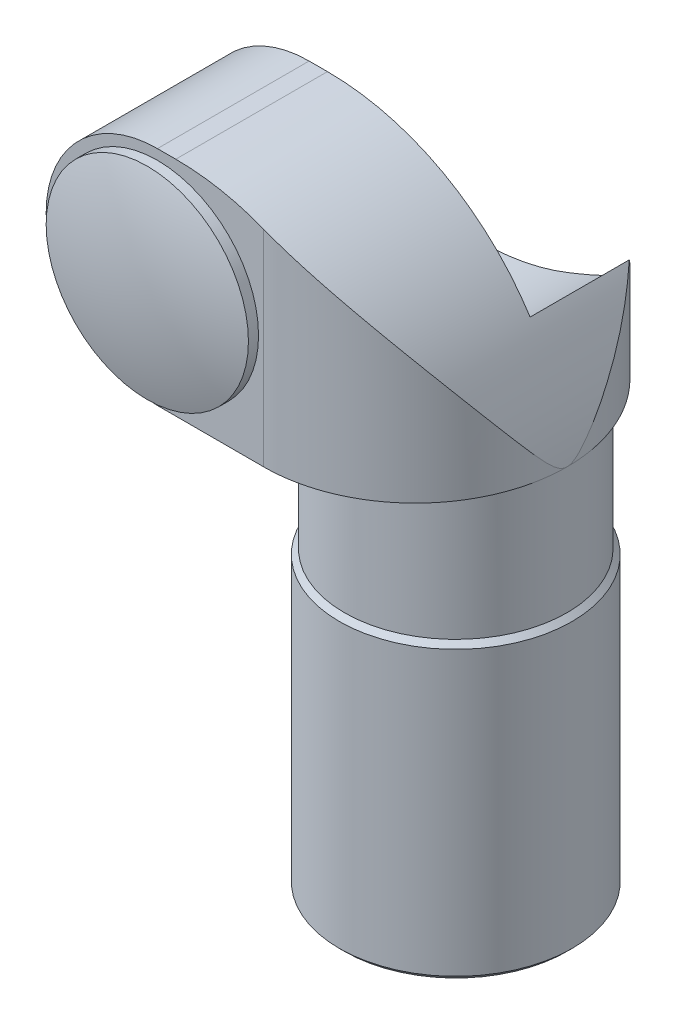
ISO-10303-21;
HEADER;
FILE_DESCRIPTION(('STEP AP214'),'2;1');
FILE_NAME('part.step','',(''),(''),'','','');
FILE_SCHEMA(('AUTOMOTIVE_DESIGN { 1 0 10303 214 1 1 1 1 }'));
ENDSEC;
DATA;
#1=APPLICATION_CONTEXT('core data for automotive mechanical design processes');
#2=APPLICATION_PROTOCOL_DEFINITION('international standard','automotive_design',2000,#1);
#3=PRODUCT_CONTEXT('',#1,'mechanical');
#4=PRODUCT('Part','Part','',(#3));
#5=PRODUCT_RELATED_PRODUCT_CATEGORY('part','',(#4));
#6=PRODUCT_DEFINITION_FORMATION('','',#4);
#7=PRODUCT_DEFINITION_CONTEXT('part definition',#1,'design');
#8=PRODUCT_DEFINITION('design','',#6,#7);
#9=PRODUCT_DEFINITION_SHAPE('','',#8);
#10=(LENGTH_UNIT() NAMED_UNIT(*) SI_UNIT(.MILLI.,.METRE.));
#11=(NAMED_UNIT(*) PLANE_ANGLE_UNIT() SI_UNIT($,.RADIAN.));
#12=(NAMED_UNIT(*) SI_UNIT($,.STERADIAN.) SOLID_ANGLE_UNIT());
#13=UNCERTAINTY_MEASURE_WITH_UNIT(LENGTH_MEASURE(1.E-05),#10,'distance_accuracy_value','');
#14=(GEOMETRIC_REPRESENTATION_CONTEXT(3) GLOBAL_UNCERTAINTY_ASSIGNED_CONTEXT((#13)) GLOBAL_UNIT_ASSIGNED_CONTEXT((#10,
#11,#12)) REPRESENTATION_CONTEXT('',''));
#15=CARTESIAN_POINT('',(0.,0.,0.));
#16=DIRECTION('',(0.,0.,1.));
#17=DIRECTION('',(1.,0.,0.));
#18=AXIS2_PLACEMENT_3D('',#15,#16,#17);
#19=CARTESIAN_POINT('',(-29.,0.,30.));
#20=DIRECTION('',(0.,0.,1.));
#21=DIRECTION('',(1.,0.,0.));
#22=AXIS2_PLACEMENT_3D('',#19,#20,#21);
#23=PLANE('',#22);
#24=DIRECTION('',(0.,1.,0.));
#25=VECTOR('',#24,1.);
#26=CARTESIAN_POINT('',(-8.,-22.,30.));
#27=LINE('',#26,#25);
#28=CARTESIAN_POINT('',(-8.,-22.,30.));
#29=VERTEX_POINT('',#28);
#30=CARTESIAN_POINT('',(-7.99999999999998,18.7097571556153,30.));
#31=VERTEX_POINT('',#30);
#32=EDGE_CURVE('E175',#29,#31,#27,.T.);
#33=ORIENTED_EDGE('',*,*,#32,.T.);
#34=CARTESIAN_POINT('',(-25.370877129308,-25.5,30.));
#35=DIRECTION('',(0.,0.,1.));
#36=DIRECTION('',(-1.,0.,0.));
#37=AXIS2_PLACEMENT_3D('',#34,#35,#36);
#38=CIRCLE('',#37,47.5);
#39=CARTESIAN_POINT('',(-25.370877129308,22.,30.));
#40=VERTEX_POINT('',#39);
#41=EDGE_CURVE('E200',#31,#40,#38,.T.);
#42=ORIENTED_EDGE('',*,*,#41,.T.);
#43=DIRECTION('',(-1.,0.,0.));
#44=VECTOR('',#43,1.);
#45=CARTESIAN_POINT('',(-29.,22.,30.));
#46=LINE('',#45,#44);
#47=CARTESIAN_POINT('',(-29.,22.,30.));
#48=VERTEX_POINT('',#47);
#49=EDGE_CURVE('E118',#40,#48,#46,.T.);
#50=ORIENTED_EDGE('',*,*,#49,.T.);
#51=CARTESIAN_POINT('',(-29.,0.,30.));
#52=DIRECTION('',(0.,0.,1.));
#53=DIRECTION('',(1.,0.,0.));
#54=AXIS2_PLACEMENT_3D('',#51,#52,#53);
#55=CIRCLE('',#54,22.);
#56=CARTESIAN_POINT('',(-29.,-22.,30.));
#57=VERTEX_POINT('',#56);
#58=EDGE_CURVE('E194',#48,#57,#55,.T.);
#59=ORIENTED_EDGE('',*,*,#58,.T.);
#60=DIRECTION('',(1.,0.,0.));
#61=VECTOR('',#60,1.);
#62=CARTESIAN_POINT('',(-29.,-22.,30.));
#63=LINE('',#62,#61);
#64=EDGE_CURVE('E197',#57,#29,#63,.T.);
#65=ORIENTED_EDGE('',*,*,#64,.T.);
#66=EDGE_LOOP('',(#33,#42,#50,#59,#65));
#67=FACE_BOUND('',#66,.T.);
#68=CARTESIAN_POINT('',(-29.,0.,30.));
#69=DIRECTION('',(0.,0.,1.));
#70=DIRECTION('',(1.,0.,0.));
#71=AXIS2_PLACEMENT_3D('',#68,#69,#70);
#72=CIRCLE('',#71,20.);
#73=CARTESIAN_POINT('',(-8.99999999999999,0.,30.));
#74=VERTEX_POINT('',#73);
#75=EDGE_CURVE('E227',#74,#74,#72,.T.);
#76=ORIENTED_EDGE('',*,*,#75,.F.);
#77=EDGE_LOOP('',(#76));
#78=FACE_BOUND('',#77,.T.);
#79=ADVANCED_FACE('F32',(#67,#78),#23,.T.);
#80=CARTESIAN_POINT('',(-29.,-22.,30.));
#81=DIRECTION('',(0.,1.,0.));
#82=DIRECTION('',(-1.,0.,0.));
#83=AXIS2_PLACEMENT_3D('',#80,#81,#82);
#84=PLANE('',#83);
#85=DIRECTION('',(0.,0.,1.));
#86=VECTOR('',#85,1.);
#87=CARTESIAN_POINT('',(-25.370877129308,-22.,-30.));
#88=LINE('',#87,#86);
#89=CARTESIAN_POINT('',(-25.370877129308,-22.,-30.));
#90=VERTEX_POINT('',#89);
#91=CARTESIAN_POINT('',(-25.370877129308,-22.,0.));
#92=VERTEX_POINT('',#91);
#93=EDGE_CURVE('E218',#90,#92,#88,.T.);
#94=ORIENTED_EDGE('',*,*,#93,.F.);
#95=DIRECTION('',(1.,0.,0.));
#96=VECTOR('',#95,1.);
#97=CARTESIAN_POINT('',(-29.,-22.,-30.));
#98=LINE('',#97,#96);
#99=CARTESIAN_POINT('',(-7.99999999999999,-22.,-30.));
#100=VERTEX_POINT('',#99);
#101=EDGE_CURVE('E55',#90,#100,#98,.T.);
#102=ORIENTED_EDGE('',*,*,#101,.T.);
#103=CARTESIAN_POINT('',(-8.,-22.,0.));
#104=DIRECTION('',(0.,-1.,0.));
#105=DIRECTION('',(1.,0.,0.));
#106=AXIS2_PLACEMENT_3D('',#103,#104,#105);
#107=CIRCLE('',#106,30.);
#108=CARTESIAN_POINT('',(22.,-22.,0.));
#109=VERTEX_POINT('',#108);
#110=EDGE_CURVE('E209',#100,#109,#107,.T.);
#111=ORIENTED_EDGE('',*,*,#110,.T.);
#112=CARTESIAN_POINT('',(0.,-22.,0.));
#113=DIRECTION('',(0.,1.,0.));
#114=DIRECTION('',(0.,0.,1.));
#115=AXIS2_PLACEMENT_3D('',#112,#113,#114);
#116=CIRCLE('',#115,22.);
#117=EDGE_CURVE('E178',#109,#109,#116,.T.);
#118=ORIENTED_EDGE('',*,*,#117,.T.);
#119=EDGE_CURVE('E207',#109,#29,#107,.T.);
#120=ORIENTED_EDGE('',*,*,#119,.T.);
#121=ORIENTED_EDGE('',*,*,#64,.F.);
#122=DIRECTION('',(0.,0.,-1.));
#123=VECTOR('',#122,1.);
#124=CARTESIAN_POINT('',(-29.,-22.,30.));
#125=LINE('',#124,#123);
#126=CARTESIAN_POINT('',(-29.,-22.,0.));
#127=VERTEX_POINT('',#126);
#128=EDGE_CURVE('E41',#57,#127,#125,.T.);
#129=ORIENTED_EDGE('',*,*,#128,.T.);
#130=DIRECTION('',(1.,0.,0.));
#131=VECTOR('',#130,1.);
#132=CARTESIAN_POINT('',(-29.,-22.,0.));
#133=LINE('',#132,#131);
#134=EDGE_CURVE('E205',#127,#92,#133,.T.);
#135=ORIENTED_EDGE('',*,*,#134,.T.);
#136=EDGE_LOOP('',(#94,#102,#111,#118,#120,#121,#129,#135));
#137=FACE_BOUND('',#136,.T.);
#138=ADVANCED_FACE('F149',(#137),#84,.F.);
#139=CARTESIAN_POINT('',(-29.,0.,30.));
#140=DIRECTION('',(0.,0.,-1.));
#141=DIRECTION('',(-1.,0.,0.));
#142=AXIS2_PLACEMENT_3D('',#139,#140,#141);
#143=CYLINDRICAL_SURFACE('',#142,22.);
#144=DIRECTION('',(0.,0.,-1.));
#145=VECTOR('',#144,1.);
#146=CARTESIAN_POINT('',(-29.,22.,30.));
#147=LINE('',#146,#145);
#148=CARTESIAN_POINT('',(-29.,22.,0.));
#149=VERTEX_POINT('',#148);
#150=EDGE_CURVE('E119',#48,#149,#147,.T.);
#151=ORIENTED_EDGE('',*,*,#150,.T.);
#152=CARTESIAN_POINT('',(-29.,0.,0.));
#153=DIRECTION('',(0.,0.,1.));
#154=DIRECTION('',(1.,0.,0.));
#155=AXIS2_PLACEMENT_3D('',#152,#153,#154);
#156=CIRCLE('',#155,22.);
#157=EDGE_CURVE('E101',#149,#127,#156,.T.);
#158=ORIENTED_EDGE('',*,*,#157,.T.);
#159=ORIENTED_EDGE('',*,*,#128,.F.);
#160=ORIENTED_EDGE('',*,*,#58,.F.);
#161=EDGE_LOOP('',(#151,#158,#159,#160));
#162=FACE_BOUND('',#161,.T.);
#163=ADVANCED_FACE('F155',(#162),#143,.T.);
#164=CARTESIAN_POINT('',(-25.370877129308,-25.5,30.));
#165=DIRECTION('',(0.,0.,-1.));
#166=DIRECTION('',(-1.,0.,0.));
#167=AXIS2_PLACEMENT_3D('',#164,#165,#166);
#168=CYLINDRICAL_SURFACE('',#167,47.5);
#169=CARTESIAN_POINT('',(-7.99999999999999,18.7097571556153,30.));
#170=CARTESIAN_POINT('',(-7.56651433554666,18.5394487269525,30.0000097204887));
#171=CARTESIAN_POINT('',(-7.1355781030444,18.362749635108,29.990605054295));
#172=CARTESIAN_POINT('',(-6.27980889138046,17.9970941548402,29.9537005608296));
#173=CARTESIAN_POINT('',(-5.85497483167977,17.8081399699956,29.9262039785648));
#174=CARTESIAN_POINT('',(-5.01290872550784,17.4187377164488,29.8539045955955));
#175=CARTESIAN_POINT('',(-4.59566595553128,17.2183078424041,29.8091285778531));
#176=CARTESIAN_POINT('',(-3.76890543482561,16.8062437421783,29.7030569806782));
#177=CARTESIAN_POINT('',(-3.35938802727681,16.5946090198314,29.6417606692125));
#178=CARTESIAN_POINT('',(-2.15202468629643,15.9483015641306,29.4357404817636));
#179=CARTESIAN_POINT('',(-1.36627834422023,15.4980098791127,29.268070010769));
#180=CARTESIAN_POINT('',(0.168412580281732,14.5600132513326,28.8774098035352));
#181=CARTESIAN_POINT('',(0.917338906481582,14.0722900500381,28.6543929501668));
#182=CARTESIAN_POINT('',(2.5531621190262,12.9410274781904,28.0988857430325));
#183=CARTESIAN_POINT('',(3.42927347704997,12.2884563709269,27.7529618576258));
#184=CARTESIAN_POINT('',(5.11749358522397,10.9400505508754,26.9960676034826));
#185=CARTESIAN_POINT('',(5.92959315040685,10.2442096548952,26.5850879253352));
#186=CARTESIAN_POINT('',(7.49285473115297,8.81259008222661,25.705633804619));
#187=CARTESIAN_POINT('',(8.24369978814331,8.07663296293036,25.2368883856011));
#188=CARTESIAN_POINT('',(9.68040760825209,6.57395304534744,24.2520491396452));
#189=CARTESIAN_POINT('',(10.3662666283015,5.80722847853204,23.7359525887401));
#190=CARTESIAN_POINT('',(11.9300216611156,3.94309939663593,22.453913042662));
#191=CARTESIAN_POINT('',(12.7782202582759,2.83356125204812,21.6691497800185));
#192=CARTESIAN_POINT('',(13.9610019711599,1.14071491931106,20.4459341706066));
#193=CARTESIAN_POINT('',(14.3404573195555,0.57147725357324,20.0303675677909));
#194=CARTESIAN_POINT('',(15.0701504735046,-0.575410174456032,19.1854034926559));
#195=CARTESIAN_POINT('',(15.420388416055,-1.15305989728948,18.7560060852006));
#196=CARTESIAN_POINT('',(16.4271284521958,-2.89526047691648,17.4505721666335));
#197=CARTESIAN_POINT('',(17.0409444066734,-4.07091858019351,16.5559483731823));
#198=CARTESIAN_POINT('',(17.8788126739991,-5.84946117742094,15.1846539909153));
#199=CARTESIAN_POINT('',(18.1442648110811,-6.44474259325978,14.722722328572));
#200=CARTESIAN_POINT('',(18.6481619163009,-7.63958107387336,13.7897254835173));
#201=CARTESIAN_POINT('',(18.8866076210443,-8.23913802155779,13.3186605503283));
#202=CARTESIAN_POINT('',(19.4348396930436,-9.70297471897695,12.1613875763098));
#203=CARTESIAN_POINT('',(19.7305689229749,-10.5690135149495,11.4706872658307));
#204=CARTESIAN_POINT('',(20.1339114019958,-11.8702367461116,10.4222411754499));
#205=CARTESIAN_POINT('',(20.2616448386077,-12.304316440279,10.0707114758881));
#206=CARTESIAN_POINT('',(20.5038360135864,-13.1726366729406,9.36328408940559));
#207=CARTESIAN_POINT('',(20.6182936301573,-13.6068772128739,9.00738636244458));
#208=CARTESIAN_POINT('',(20.8756491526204,-14.6421721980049,8.15267084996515));
#209=CARTESIAN_POINT('',(21.0124862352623,-15.2429587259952,7.65168036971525));
#210=CARTESIAN_POINT('',(21.1987780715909,-16.1399604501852,6.89195452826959));
#211=CARTESIAN_POINT('',(21.2576644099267,-16.4379635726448,6.63760221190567));
#212=CARTESIAN_POINT('',(21.3691969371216,-17.0320158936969,6.12527867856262));
#213=CARTESIAN_POINT('',(21.4218433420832,-17.3280651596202,5.86730758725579));
#214=CARTESIAN_POINT('',(21.5346196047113,-17.9986796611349,5.27454582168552));
#215=CARTESIAN_POINT('',(21.5927807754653,-18.3722699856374,4.93827638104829));
#216=CARTESIAN_POINT('',(21.6992110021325,-19.1127530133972,4.25192076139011));
#217=CARTESIAN_POINT('',(21.747413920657,-19.4795870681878,3.9017595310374));
#218=CARTESIAN_POINT('',(21.8119658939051,-20.0170583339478,3.35860630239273));
#219=CARTESIAN_POINT('',(21.832286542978,-20.1950858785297,3.17343622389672));
#220=CARTESIAN_POINT('',(21.8701342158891,-20.5434422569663,2.79489319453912));
#221=CARTESIAN_POINT('',(21.8876555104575,-20.7137548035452,2.60150442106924));
#222=CARTESIAN_POINT('',(21.9194864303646,-21.0392872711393,2.20534221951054));
#223=CARTESIAN_POINT('',(21.9338268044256,-21.1946426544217,2.00268376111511));
#224=CARTESIAN_POINT('',(21.9590429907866,-21.4814199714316,1.58118958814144));
#225=CARTESIAN_POINT('',(21.9699344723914,-21.6129489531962,1.36243277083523));
#226=CARTESIAN_POINT('',(21.9837749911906,-21.7863358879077,0.995881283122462));
#227=CARTESIAN_POINT('',(21.9881533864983,-21.8429202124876,0.855330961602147));
#228=CARTESIAN_POINT('',(21.9949833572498,-21.9324673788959,0.567099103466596));
#229=CARTESIAN_POINT('',(21.9974427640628,-21.9655261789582,0.419449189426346));
#230=CARTESIAN_POINT('',(22.0001466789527,-22.0019239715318,0.118381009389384));
#231=CARTESIAN_POINT('',(22.0003631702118,-22.0048870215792,-0.0350862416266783));
#232=CARTESIAN_POINT('',(21.9984675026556,-21.9793046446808,-0.339504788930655));
#233=CARTESIAN_POINT('',(21.9963500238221,-21.9506872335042,-0.490449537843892));
#234=CARTESIAN_POINT('',(21.9893426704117,-21.8582881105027,-0.820270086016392));
#235=CARTESIAN_POINT('',(21.9839083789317,-21.7877030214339,-0.997129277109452));
#236=CARTESIAN_POINT('',(21.9706034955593,-21.62169877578,-1.33878747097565));
#237=CARTESIAN_POINT('',(21.9627231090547,-21.5261800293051,-1.50353463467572));
#238=CARTESIAN_POINT('',(21.9384457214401,-21.2444524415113,-1.94091229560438));
#239=CARTESIAN_POINT('',(21.9200528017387,-21.0432950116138,-2.20354789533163));
#240=CARTESIAN_POINT('',(21.8782979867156,-20.6202954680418,-2.71145371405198));
#241=CARTESIAN_POINT('',(21.8549210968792,-20.3983920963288,-2.95666848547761));
#242=CARTESIAN_POINT('',(21.8034022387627,-19.942088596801,-3.43742704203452));
#243=CARTESIAN_POINT('',(21.7752327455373,-19.7076219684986,-3.67290460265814));
#244=CARTESIAN_POINT('',(21.7144260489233,-19.2324943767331,-4.13609641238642));
#245=CARTESIAN_POINT('',(21.681795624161,-18.9918432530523,-4.36382179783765));
#246=CARTESIAN_POINT('',(21.6124179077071,-18.5086468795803,-4.81202947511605));
#247=CARTESIAN_POINT('',(21.5757114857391,-18.2661397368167,-5.0325592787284));
#248=CARTESIAN_POINT('',(21.4979657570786,-17.7784327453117,-5.46985268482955));
#249=CARTESIAN_POINT('',(21.456926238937,-17.5332327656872,-5.68661610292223));
#250=CARTESIAN_POINT('',(21.327307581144,-16.7948813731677,-6.33263325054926));
#251=CARTESIAN_POINT('',(21.23223937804,-16.2990559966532,-6.75754322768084));
#252=CARTESIAN_POINT('',(21.0246500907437,-15.3037208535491,-7.59985308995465));
#253=CARTESIAN_POINT('',(20.9121089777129,-14.8042074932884,-8.01724373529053));
#254=CARTESIAN_POINT('',(20.6695491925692,-13.8041083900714,-8.84551530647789));
#255=CARTESIAN_POINT('',(20.5395321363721,-13.3035227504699,-9.25639683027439));
#256=CARTESIAN_POINT('',(20.2622292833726,-12.3038653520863,-10.0713009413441));
#257=CARTESIAN_POINT('',(20.1149904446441,-11.8047931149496,-10.4753388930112));
#258=CARTESIAN_POINT('',(19.8027933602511,-10.807742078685,-11.2778552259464));
#259=CARTESIAN_POINT('',(19.6378348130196,-10.3097632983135,-11.6763335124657));
#260=CARTESIAN_POINT('',(19.1161909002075,-8.81890038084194,-12.8630936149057));
#261=CARTESIAN_POINT('',(18.7326056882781,-7.82861250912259,-13.6430884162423));
#262=CARTESIAN_POINT('',(18.0501654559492,-6.23063019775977,-14.8891363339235));
#263=CARTESIAN_POINT('',(17.7737582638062,-5.61921982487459,-15.3628563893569));
#264=CARTESIAN_POINT('',(17.1918194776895,-4.40208764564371,-16.2995801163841));
#265=CARTESIAN_POINT('',(16.886286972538,-3.79636601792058,-16.7625834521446));
#266=CARTESIAN_POINT('',(15.9248222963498,-1.98875820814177,-18.1342348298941));
#267=CARTESIAN_POINT('',(15.2241350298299,-0.796693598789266,-19.0253177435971));
#268=CARTESIAN_POINT('',(14.0806664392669,0.963467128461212,-20.3168513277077));
#269=CARTESIAN_POINT('',(13.6841269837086,1.5455017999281,-20.7398265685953));
#270=CARTESIAN_POINT('',(12.8595257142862,2.69909858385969,-21.5690095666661));
#271=CARTESIAN_POINT('',(12.4314626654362,3.27066028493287,-21.9752166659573));
#272=CARTESIAN_POINT('',(11.0995658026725,4.96672972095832,-23.1651360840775));
#273=CARTESIAN_POINT('',(10.1472862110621,6.07376735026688,-23.9209907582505));
#274=CARTESIAN_POINT('',(8.51158018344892,7.80220969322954,-25.0586057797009));
#275=CARTESIAN_POINT('',(7.86966048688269,8.44341721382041,-25.4706040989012));
#276=CARTESIAN_POINT('',(6.53680472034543,9.69925774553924,-26.2541179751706));
#277=CARTESIAN_POINT('',(5.84587424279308,10.3138937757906,-26.6256381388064));
#278=CARTESIAN_POINT('',(4.41787795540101,11.510059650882,-27.3207734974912));
#279=CARTESIAN_POINT('',(3.68098884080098,12.0917016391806,-27.6445577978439));
#280=CARTESIAN_POINT('',(2.15994560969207,13.2194989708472,-28.2390138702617));
#281=CARTESIAN_POINT('',(1.37579569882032,13.7656574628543,-28.5096903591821));
#282=CARTESIAN_POINT('',(-0.0893003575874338,14.7207704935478,-28.9463868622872));
#283=CARTESIAN_POINT('',(-0.762822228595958,15.1365259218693,-29.1224958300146));
#284=CARTESIAN_POINT('',(-2.13742470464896,15.9377707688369,-29.4300145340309));
#285=CARTESIAN_POINT('',(-2.83849538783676,16.3232709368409,-29.5614402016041));
#286=CARTESIAN_POINT('',(-3.91114854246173,16.8779901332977,-29.7222730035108));
#287=CARTESIAN_POINT('',(-4.27368781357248,17.0596477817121,-29.7699489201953));
#288=CARTESIAN_POINT('',(-5.00450980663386,17.4141696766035,-29.8523403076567));
#289=CARTESIAN_POINT('',(-5.37279235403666,17.5870341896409,-29.887056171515));
#290=CARTESIAN_POINT('',(-6.11493402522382,17.9237818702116,-29.9430314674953));
#291=CARTESIAN_POINT('',(-6.48879872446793,18.0876551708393,-29.964276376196));
#292=CARTESIAN_POINT('',(-7.2411232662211,18.4059118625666,-29.9927644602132));
#293=CARTESIAN_POINT('',(-7.61958365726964,18.5602941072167,-30.0000059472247));
#294=CARTESIAN_POINT('',(-7.99999999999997,18.7097571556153,-30.));
#295=B_SPLINE_CURVE_WITH_KNOTS('',3,(#169,#170,#171,#172,#173,#174,#175,#176,#177,#178,#179,
#180,#181,#182,#183,#184,#185,#186,#187,#188,#189,#190,#191,#192,#193,#194,#195,#196,#197,#198,
#199,#200,#201,#202,#203,#204,#205,#206,#207,#208,#209,#210,#211,#212,#213,#214,#215,#216,#217,
#218,#219,#220,#221,#222,#223,#224,#225,#226,#227,#228,#229,#230,#231,#232,#233,#234,#235,#236,
#237,#238,#239,#240,#241,#242,#243,#244,#245,#246,#247,#248,#249,#250,#251,#252,#253,#254,#255,
#256,#257,#258,#259,#260,#261,#262,#263,#264,#265,#266,#267,#268,#269,#270,#271,#272,#273,#274,
#275,#276,#277,#278,#279,#280,#281,#282,#283,#284,#285,#286,#287,#288,#289,#290,#291,#292,#293,
#294),.UNSPECIFIED.,.F.,.F.,(4,2,2,2,2,2,2,2,2,2,2,2,2,2,2,2,2,2,2,2,2,2,2,2,2,2,2,2,2,2,2,2,2,
2,2,2,2,2,2,2,2,2,2,2,2,2,2,2,2,2,2,2,2,2,2,2,2,2,2,2,2,2,4),(0.,1.39702311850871,
2.79379573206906,4.18841200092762,5.58309007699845,8.34239851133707,11.1030615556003,
14.5356517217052,17.9687335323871,21.4185809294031,24.8686269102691,29.6669298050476,
32.0677195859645,34.4684981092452,39.2621903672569,41.6584374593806,44.0546191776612,
47.4926192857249,49.2114437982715,50.9302840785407,53.3121675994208,54.5006931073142,
55.6891774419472,57.2069868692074,58.7345738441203,59.5074392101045,60.2818666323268,
61.0484457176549,61.8114903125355,62.2647675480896,62.7161851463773,63.1732348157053,
63.631328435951,64.1996278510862,64.7702328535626,65.7614555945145,66.7557036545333,
67.7558675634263,68.7545282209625,69.7439519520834,70.7334239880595,72.7126842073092,
74.6942301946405,76.6755930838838,78.6516741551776,80.6277888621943,84.578134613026,
87.0416653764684,89.505273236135,94.433547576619,96.8974285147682,99.3614060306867,
104.284569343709,107.272032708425,110.259155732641,113.235428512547,116.211436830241,
118.64202426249,121.071744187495,122.296357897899,123.520934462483,124.746829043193,
125.972871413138),.UNSPECIFIED.);
#296=CARTESIAN_POINT('',(14.7040526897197,0.,-19.609334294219));
#297=VERTEX_POINT('',#296);
#298=EDGE_CURVE('E168',#109,#297,#295,.T.);
#299=ORIENTED_EDGE('',*,*,#298,.T.);
#300=DIRECTION('',(0.,0.,1.));
#301=VECTOR('',#300,1.);
#302=CARTESIAN_POINT('',(14.7040526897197,0.,-30.));
#303=LINE('',#302,#301);
#304=CARTESIAN_POINT('',(14.7040526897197,0.,0.));
#305=VERTEX_POINT('',#304);
#306=EDGE_CURVE('E48',#297,#305,#303,.T.);
#307=ORIENTED_EDGE('',*,*,#306,.T.);
#308=CARTESIAN_POINT('',(-25.370877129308,-25.5,0.));
#309=DIRECTION('',(0.,0.,1.));
#310=DIRECTION('',(1.,0.,0.));
#311=AXIS2_PLACEMENT_3D('',#308,#309,#310);
#312=CIRCLE('',#311,47.5);
#313=CARTESIAN_POINT('',(-25.370877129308,22.,0.));
#314=VERTEX_POINT('',#313);
#315=EDGE_CURVE('E99',#305,#314,#312,.T.);
#316=ORIENTED_EDGE('',*,*,#315,.T.);
#317=DIRECTION('',(0.,0.,-1.));
#318=VECTOR('',#317,1.);
#319=CARTESIAN_POINT('',(-25.370877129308,22.,30.));
#320=LINE('',#319,#318);
#321=EDGE_CURVE('E112',#40,#314,#320,.T.);
#322=ORIENTED_EDGE('',*,*,#321,.F.);
#323=ORIENTED_EDGE('',*,*,#41,.F.);
#324=EDGE_CURVE('E174',#31,#109,#295,.T.);
#325=ORIENTED_EDGE('',*,*,#324,.T.);
#326=EDGE_LOOP('',(#299,#307,#316,#322,#323,#325));
#327=FACE_BOUND('',#326,.T.);
#328=ADVANCED_FACE('F110',(#327),#168,.T.);
#329=CARTESIAN_POINT('',(-29.,22.,30.));
#330=DIRECTION('',(0.,-1.,0.));
#331=DIRECTION('',(0.,0.,-1.));
#332=AXIS2_PLACEMENT_3D('',#329,#330,#331);
#333=PLANE('',#332);
#334=ORIENTED_EDGE('',*,*,#321,.T.);
#335=DIRECTION('',(-1.,0.,0.));
#336=VECTOR('',#335,1.);
#337=CARTESIAN_POINT('',(-25.370877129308,22.,0.));
#338=LINE('',#337,#336);
#339=EDGE_CURVE('E96',#314,#149,#338,.T.);
#340=ORIENTED_EDGE('',*,*,#339,.T.);
#341=ORIENTED_EDGE('',*,*,#150,.F.);
#342=ORIENTED_EDGE('',*,*,#49,.F.);
#343=EDGE_LOOP('',(#334,#340,#341,#342));
#344=FACE_BOUND('',#343,.T.);
#345=ADVANCED_FACE('F117',(#344),#333,.F.);
#346=CARTESIAN_POINT('',(-29.,0.,-30.));
#347=DIRECTION('',(0.,0.,1.));
#348=DIRECTION('',(1.,0.,0.));
#349=AXIS2_PLACEMENT_3D('',#346,#347,#348);
#350=PLANE('',#349);
#351=ORIENTED_EDGE('',*,*,#101,.F.);
#352=CARTESIAN_POINT('',(-25.370877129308,25.5,-30.));
#353=DIRECTION('',(0.,0.,1.));
#354=DIRECTION('',(-1.,0.,0.));
#355=AXIS2_PLACEMENT_3D('',#352,#353,#354);
#356=CIRCLE('',#355,47.5);
#357=CARTESIAN_POINT('',(-8.,-18.7097571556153,-30.));
#358=VERTEX_POINT('',#357);
#359=EDGE_CURVE('E114',#90,#358,#356,.T.);
#360=ORIENTED_EDGE('',*,*,#359,.T.);
#361=DIRECTION('',(0.,1.,0.));
#362=VECTOR('',#361,1.);
#363=CARTESIAN_POINT('',(-8.00000000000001,-22.,-30.));
#364=LINE('',#363,#362);
#365=EDGE_CURVE('E176',#100,#358,#364,.T.);
#366=ORIENTED_EDGE('',*,*,#365,.F.);
#367=EDGE_LOOP('',(#351,#360,#366));
#368=FACE_BOUND('',#367,.T.);
#369=ADVANCED_FACE('F161',(#368),#350,.F.);
#370=CARTESIAN_POINT('',(22.,-105.,0.));
#371=DIRECTION('',(0.,1.,0.));
#372=DIRECTION('',(0.,0.,1.));
#373=AXIS2_PLACEMENT_3D('',#370,#371,#372);
#374=PLANE('',#373);
#375=CARTESIAN_POINT('',(0.,-105.,0.));
#376=DIRECTION('',(0.,1.,0.));
#377=DIRECTION('',(0.,0.,1.));
#378=AXIS2_PLACEMENT_3D('',#375,#376,#377);
#379=CIRCLE('',#378,22.);
#380=CARTESIAN_POINT('',(0.,-105.,22.));
#381=VERTEX_POINT('',#380);
#382=EDGE_CURVE('E190',#381,#381,#379,.T.);
#383=ORIENTED_EDGE('',*,*,#382,.F.);
#384=EDGE_LOOP('',(#383));
#385=FACE_BOUND('',#384,.T.);
#386=ADVANCED_FACE('F254',(#385),#374,.F.);
#387=CARTESIAN_POINT('',(0.,-105.,0.));
#388=DIRECTION('',(0.,1.,0.));
#389=DIRECTION('',(0.,0.,1.));
#390=AXIS2_PLACEMENT_3D('',#387,#388,#389);
#391=CONICAL_SURFACE('',#390,22.,0.785398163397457);
#392=CARTESIAN_POINT('',(0.,-104.,0.));
#393=DIRECTION('',(0.,1.,0.));
#394=DIRECTION('',(0.,0.,1.));
#395=AXIS2_PLACEMENT_3D('',#392,#393,#394);
#396=CIRCLE('',#395,23.);
#397=CARTESIAN_POINT('',(0.,-104.,23.));
#398=VERTEX_POINT('',#397);
#399=EDGE_CURVE('E187',#398,#398,#396,.T.);
#400=ORIENTED_EDGE('',*,*,#399,.F.);
#401=EDGE_LOOP('',(#400));
#402=FACE_BOUND('',#401,.T.);
#403=ORIENTED_EDGE('',*,*,#382,.T.);
#404=EDGE_LOOP('',(#403));
#405=FACE_BOUND('',#404,.T.);
#406=ADVANCED_FACE('F251',(#402,#405),#391,.T.);
#407=CARTESIAN_POINT('',(0.,22.74636757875,0.));
#408=DIRECTION('',(0.,1.,0.));
#409=DIRECTION('',(0.,0.,1.));
#410=AXIS2_PLACEMENT_3D('',#407,#408,#409);
#411=CYLINDRICAL_SURFACE('',#410,23.);
#412=CARTESIAN_POINT('',(0.,-48.,0.));
#413=DIRECTION('',(0.,1.,0.));
#414=DIRECTION('',(0.,0.,1.));
#415=AXIS2_PLACEMENT_3D('',#412,#413,#414);
#416=CIRCLE('',#415,23.);
#417=CARTESIAN_POINT('',(0.,-48.,23.));
#418=VERTEX_POINT('',#417);
#419=EDGE_CURVE('E184',#418,#418,#416,.T.);
#420=ORIENTED_EDGE('',*,*,#419,.F.);
#421=EDGE_LOOP('',(#420));
#422=FACE_BOUND('',#421,.T.);
#423=ORIENTED_EDGE('',*,*,#399,.T.);
#424=EDGE_LOOP('',(#423));
#425=FACE_BOUND('',#424,.T.);
#426=ADVANCED_FACE('F244',(#422,#425),#411,.T.);
#427=CARTESIAN_POINT('',(0.,-48.,0.));
#428=DIRECTION('',(0.,-1.,0.));
#429=DIRECTION('',(0.,0.,-1.));
#430=AXIS2_PLACEMENT_3D('',#427,#428,#429);
#431=CONICAL_SURFACE('',#430,23.,0.78539816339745);
#432=CARTESIAN_POINT('',(0.,-47.,0.));
#433=DIRECTION('',(0.,1.,0.));
#434=DIRECTION('',(0.,0.,1.));
#435=AXIS2_PLACEMENT_3D('',#432,#433,#434);
#436=CIRCLE('',#435,22.);
#437=CARTESIAN_POINT('',(0.,-47.,22.));
#438=VERTEX_POINT('',#437);
#439=EDGE_CURVE('E181',#438,#438,#436,.T.);
#440=ORIENTED_EDGE('',*,*,#439,.F.);
#441=EDGE_LOOP('',(#440));
#442=FACE_BOUND('',#441,.T.);
#443=ORIENTED_EDGE('',*,*,#419,.T.);
#444=EDGE_LOOP('',(#443));
#445=FACE_BOUND('',#444,.T.);
#446=ADVANCED_FACE('F239',(#442,#445),#431,.T.);
#447=CARTESIAN_POINT('',(0.,22.74636757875,0.));
#448=DIRECTION('',(0.,1.,0.));
#449=DIRECTION('',(0.,0.,1.));
#450=AXIS2_PLACEMENT_3D('',#447,#448,#449);
#451=CYLINDRICAL_SURFACE('',#450,22.);
#452=ORIENTED_EDGE('',*,*,#117,.F.);
#453=EDGE_LOOP('',(#452));
#454=FACE_BOUND('',#453,.T.);
#455=ORIENTED_EDGE('',*,*,#439,.T.);
#456=EDGE_LOOP('',(#455));
#457=FACE_BOUND('',#456,.T.);
#458=ADVANCED_FACE('F234',(#454,#457),#451,.T.);
#459=CARTESIAN_POINT('',(-8.,-22.,0.));
#460=DIRECTION('',(0.,1.,0.));
#461=DIRECTION('',(-1.,0.,0.));
#462=AXIS2_PLACEMENT_3D('',#459,#460,#461);
#463=CYLINDRICAL_SURFACE('',#462,30.);
#464=ORIENTED_EDGE('',*,*,#365,.T.);
#465=CARTESIAN_POINT('',(-7.99999999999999,-18.7097571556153,-30.));
#466=CARTESIAN_POINT('',(-7.56658807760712,-18.5394776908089,-30.0000097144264));
#467=CARTESIAN_POINT('',(-7.13572470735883,-18.3628097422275,-29.9906082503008));
#468=CARTESIAN_POINT('',(-6.28009896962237,-17.9972206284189,-29.9537161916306));
#469=CARTESIAN_POINT('',(-5.85533552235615,-17.8083016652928,-29.9262288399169));
#470=CARTESIAN_POINT('',(-5.01339853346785,-17.4189693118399,-29.8539527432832));
#471=CARTESIAN_POINT('',(-4.59621442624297,-17.2185738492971,-29.8091903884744));
#472=CARTESIAN_POINT('',(-3.76956857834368,-16.8065816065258,-29.7031506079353));
#473=CARTESIAN_POINT('',(-3.36010718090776,-16.5949843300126,-29.6418724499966));
#474=CARTESIAN_POINT('',(-2.1526499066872,-15.9486553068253,-29.4358687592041));
#475=CARTESIAN_POINT('',(-1.36675984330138,-15.4982952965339,-29.2681829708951));
#476=CARTESIAN_POINT('',(0.168189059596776,-14.5601587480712,-28.8774763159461));
#477=CARTESIAN_POINT('',(0.917230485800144,-14.0723647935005,-28.6544295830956));
#478=CARTESIAN_POINT('',(2.55322538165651,-12.9409840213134,-28.0988644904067));
#479=CARTESIAN_POINT('',(3.42939449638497,-12.288367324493,-27.7529149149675));
#480=CARTESIAN_POINT('',(5.11779458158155,-10.9398025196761,-26.9959253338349));
#481=CARTESIAN_POINT('',(5.93001137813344,-10.2438448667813,-26.584870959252));
#482=CARTESIAN_POINT('',(7.4933750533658,-8.81209525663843,-25.7053226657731));
#483=CARTESIAN_POINT('',(8.24421177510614,-8.07612894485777,-25.2365638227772));
#484=CARTESIAN_POINT('',(9.68079322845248,-6.57351821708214,-24.2517583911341));
#485=CARTESIAN_POINT('',(10.3665535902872,-5.80688123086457,-23.7357232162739));
#486=CARTESIAN_POINT('',(11.3627329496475,-4.61935852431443,-22.9189997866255));
#487=CARTESIAN_POINT('',(11.6963563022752,-4.20770924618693,-22.6328084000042));
#488=CARTESIAN_POINT('',(12.3463032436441,-3.37805226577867,-22.050358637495));
#489=CARTESIAN_POINT('',(12.6626300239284,-2.96004575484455,-21.7541021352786));
#490=CARTESIAN_POINT('',(13.2759812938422,-2.12133751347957,-21.1545553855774));
#491=CARTESIAN_POINT('',(13.5731311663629,-1.70067853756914,-20.8513333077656));
#492=CARTESIAN_POINT('',(14.1509226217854,-0.854124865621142,-20.2364643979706));
#493=CARTESIAN_POINT('',(14.4315625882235,-0.428229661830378,-19.9248167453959));
#494=CARTESIAN_POINT('',(14.7040526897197,0.,-19.609334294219));
#495=B_SPLINE_CURVE_WITH_KNOTS('',3,(#465,#466,#467,#468,#469,#470,#471,#472,#473,#474,#475,
#476,#477,#478,#479,#480,#481,#482,#483,#484,#485,#486,#487,#488,#489,#490,#491,#492,#493,#494),
.UNSPECIFIED.,.F.,.F.,(4,2,2,2,2,2,2,2,2,2,2,2,2,2,4),(0.,1.39678554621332,2.79332071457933,
4.18773086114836,5.58220283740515,8.34198597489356,11.1030609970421,14.5358925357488,
17.9694827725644,21.4194698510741,24.868626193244,26.6749744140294,28.4809881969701,
30.2736537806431,32.0664945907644),.UNSPECIFIED.);
#496=EDGE_CURVE('E11',#358,#297,#495,.T.);
#497=ORIENTED_EDGE('',*,*,#496,.T.);
#498=ORIENTED_EDGE('',*,*,#298,.F.);
#499=ORIENTED_EDGE('',*,*,#110,.F.);
#500=EDGE_LOOP('',(#464,#497,#498,#499));
#501=FACE_BOUND('',#500,.T.);
#502=ADVANCED_FACE('F232',(#501),#463,.T.);
#503=ORIENTED_EDGE('',*,*,#324,.F.);
#504=ORIENTED_EDGE('',*,*,#32,.F.);
#505=ORIENTED_EDGE('',*,*,#119,.F.);
#506=EDGE_LOOP('',(#503,#504,#505));
#507=FACE_BOUND('',#506,.T.);
#508=ADVANCED_FACE('F130',(#507),#463,.T.);
#509=CARTESIAN_POINT('',(-25.370877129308,25.5,-30.));
#510=DIRECTION('',(0.,0.,1.));
#511=DIRECTION('',(1.,0.,0.));
#512=AXIS2_PLACEMENT_3D('',#509,#510,#511);
#513=CYLINDRICAL_SURFACE('',#512,47.5);
#514=ORIENTED_EDGE('',*,*,#359,.F.);
#515=ORIENTED_EDGE('',*,*,#93,.T.);
#516=CARTESIAN_POINT('',(-25.370877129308,25.5,0.));
#517=DIRECTION('',(0.,0.,1.));
#518=DIRECTION('',(-1.,0.,0.));
#519=AXIS2_PLACEMENT_3D('',#516,#517,#518);
#520=CIRCLE('',#519,47.5);
#521=EDGE_CURVE('E115',#92,#305,#520,.T.);
#522=ORIENTED_EDGE('',*,*,#521,.T.);
#523=ORIENTED_EDGE('',*,*,#306,.F.);
#524=ORIENTED_EDGE('',*,*,#496,.F.);
#525=EDGE_LOOP('',(#514,#515,#522,#523,#524));
#526=FACE_BOUND('',#525,.T.);
#527=ADVANCED_FACE('F133',(#526),#513,.F.);
#528=CARTESIAN_POINT('',(-25.370877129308,-25.5,0.));
#529=DIRECTION('',(0.,0.,1.));
#530=DIRECTION('',(1.,0.,0.));
#531=AXIS2_PLACEMENT_3D('',#528,#529,#530);
#532=PLANE('',#531);
#533=ORIENTED_EDGE('',*,*,#315,.F.);
#534=ORIENTED_EDGE('',*,*,#521,.F.);
#535=ORIENTED_EDGE('',*,*,#134,.F.);
#536=ORIENTED_EDGE('',*,*,#157,.F.);
#537=ORIENTED_EDGE('',*,*,#339,.F.);
#538=EDGE_LOOP('',(#533,#534,#535,#536,#537));
#539=FACE_BOUND('',#538,.T.);
#540=ADVANCED_FACE('F98',(#539),#532,.F.);
#541=CARTESIAN_POINT('',(-29.,0.,32.));
#542=DIRECTION('',(0.,0.,-1.));
#543=DIRECTION('',(-1.,0.,0.));
#544=AXIS2_PLACEMENT_3D('',#541,#542,#543);
#545=CYLINDRICAL_SURFACE('',#544,20.);
#546=CARTESIAN_POINT('',(-29.,0.,32.));
#547=DIRECTION('',(0.,0.,1.));
#548=DIRECTION('',(1.,0.,0.));
#549=AXIS2_PLACEMENT_3D('',#546,#547,#548);
#550=CIRCLE('',#549,20.);
#551=CARTESIAN_POINT('',(-8.99999999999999,0.,32.));
#552=VERTEX_POINT('',#551);
#553=EDGE_CURVE('E36',#552,#552,#550,.T.);
#554=ORIENTED_EDGE('',*,*,#553,.F.);
#555=EDGE_LOOP('',(#554));
#556=FACE_BOUND('',#555,.T.);
#557=ORIENTED_EDGE('',*,*,#75,.T.);
#558=EDGE_LOOP('',(#557));
#559=FACE_BOUND('',#558,.T.);
#560=ADVANCED_FACE('F139',(#556,#559),#545,.T.);
#561=CARTESIAN_POINT('',(-29.,0.,-33.1666666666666));
#562=DIRECTION('',(0.,0.,1.));
#563=DIRECTION('',(1.,0.,0.));
#564=AXIS2_PLACEMENT_3D('',#561,#562,#563);
#565=SPHERICAL_SURFACE('',#564,68.1666666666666);
#566=ORIENTED_EDGE('',*,*,#553,.T.);
#567=EDGE_LOOP('',(#566));
#568=FACE_BOUND('',#567,.T.);
#569=ADVANCED_FACE('F34',(#568),#565,.T.);
#570=CLOSED_SHELL('',(#79,#138,#163,#328,#345,#369,#386,#406,#426,#446,#458,#502,#508,#527,#540,
#560,#569));
#571=MANIFOLD_SOLID_BREP('B2',#570);
#572=ADVANCED_BREP_SHAPE_REPRESENTATION('',(#18,#571),#14);
#573=SHAPE_DEFINITION_REPRESENTATION(#9,#572);
ENDSEC;
END-ISO-10303-21;
